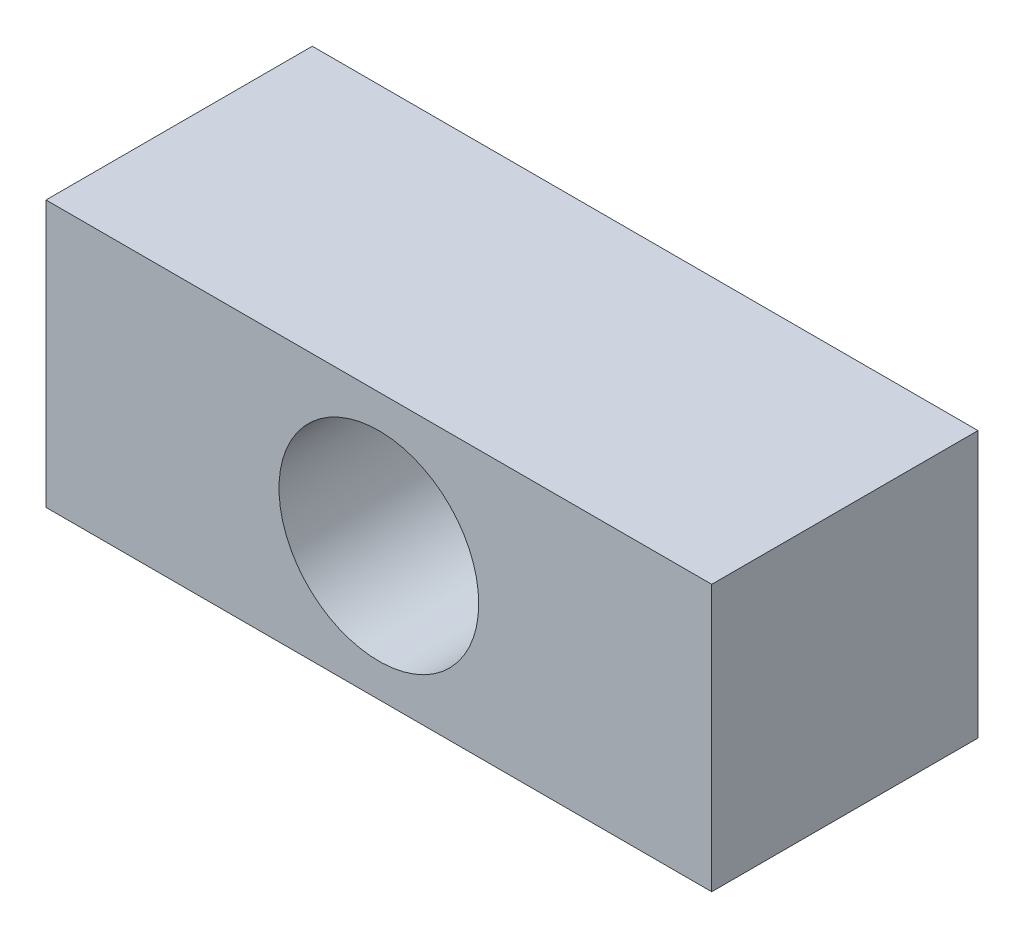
ISO-10303-21;
HEADER;
FILE_DESCRIPTION(('STEP AP214'),'2;1');
FILE_NAME('part.step','',(''),(''),'','','');
FILE_SCHEMA(('AUTOMOTIVE_DESIGN { 1 0 10303 214 1 1 1 1 }'));
ENDSEC;
DATA;
#1=APPLICATION_CONTEXT('core data for automotive mechanical design processes');
#2=APPLICATION_PROTOCOL_DEFINITION('international standard','automotive_design',2000,#1);
#3=PRODUCT_CONTEXT('',#1,'mechanical');
#4=PRODUCT('Part','Part','',(#3));
#5=PRODUCT_RELATED_PRODUCT_CATEGORY('part','',(#4));
#6=PRODUCT_DEFINITION_FORMATION('','',#4);
#7=PRODUCT_DEFINITION_CONTEXT('part definition',#1,'design');
#8=PRODUCT_DEFINITION('design','',#6,#7);
#9=PRODUCT_DEFINITION_SHAPE('','',#8);
#10=(LENGTH_UNIT() NAMED_UNIT(*) SI_UNIT(.MILLI.,.METRE.));
#11=(NAMED_UNIT(*) PLANE_ANGLE_UNIT() SI_UNIT($,.RADIAN.));
#12=(NAMED_UNIT(*) SI_UNIT($,.STERADIAN.) SOLID_ANGLE_UNIT());
#13=UNCERTAINTY_MEASURE_WITH_UNIT(LENGTH_MEASURE(1.E-05),#10,'distance_accuracy_value','');
#14=(GEOMETRIC_REPRESENTATION_CONTEXT(3) GLOBAL_UNCERTAINTY_ASSIGNED_CONTEXT((#13)) GLOBAL_UNIT_ASSIGNED_CONTEXT((#10,
#11,#12)) REPRESENTATION_CONTEXT('',''));
#15=CARTESIAN_POINT('',(0.,0.,0.));
#16=DIRECTION('',(0.,0.,1.));
#17=DIRECTION('',(1.,0.,0.));
#18=AXIS2_PLACEMENT_3D('',#15,#16,#17);
#19=CARTESIAN_POINT('',(0.,0.,40.));
#20=DIRECTION('',(0.,0.,-1.));
#21=DIRECTION('',(-1.,0.,0.));
#22=AXIS2_PLACEMENT_3D('',#19,#20,#21);
#23=PLANE('',#22);
#24=DIRECTION('',(0.,-1.,0.));
#25=VECTOR('',#24,1.);
#26=CARTESIAN_POINT('',(0.,0.,40.));
#27=LINE('',#26,#25);
#28=CARTESIAN_POINT('',(0.,40.,40.));
#29=VERTEX_POINT('',#28);
#30=CARTESIAN_POINT('',(0.,0.,40.));
#31=VERTEX_POINT('',#30);
#32=EDGE_CURVE('E84',#29,#31,#27,.T.);
#33=ORIENTED_EDGE('',*,*,#32,.T.);
#34=DIRECTION('',(1.,0.,0.));
#35=VECTOR('',#34,1.);
#36=CARTESIAN_POINT('',(0.,0.,40.));
#37=LINE('',#36,#35);
#38=CARTESIAN_POINT('',(100.,0.,40.));
#39=VERTEX_POINT('',#38);
#40=EDGE_CURVE('E79',#31,#39,#37,.T.);
#41=ORIENTED_EDGE('',*,*,#40,.T.);
#42=DIRECTION('',(0.,1.,0.));
#43=VECTOR('',#42,1.);
#44=CARTESIAN_POINT('',(100.,0.,40.));
#45=LINE('',#44,#43);
#46=CARTESIAN_POINT('',(100.,40.,40.));
#47=VERTEX_POINT('',#46);
#48=EDGE_CURVE('E82',#39,#47,#45,.T.);
#49=ORIENTED_EDGE('',*,*,#48,.T.);
#50=DIRECTION('',(-1.,0.,0.));
#51=VECTOR('',#50,1.);
#52=CARTESIAN_POINT('',(0.,40.,40.));
#53=LINE('',#52,#51);
#54=EDGE_CURVE('E49',#47,#29,#53,.T.);
#55=ORIENTED_EDGE('',*,*,#54,.T.);
#56=EDGE_LOOP('',(#33,#41,#49,#55));
#57=FACE_BOUND('',#56,.T.);
#58=CARTESIAN_POINT('',(50.,20.,40.));
#59=DIRECTION('',(0.,0.,1.));
#60=DIRECTION('',(1.,0.,0.));
#61=AXIS2_PLACEMENT_3D('',#58,#59,#60);
#62=CIRCLE('',#61,15.);
#63=CARTESIAN_POINT('',(65.,20.,40.));
#64=VERTEX_POINT('',#63);
#65=EDGE_CURVE('E99',#64,#64,#62,.T.);
#66=ORIENTED_EDGE('',*,*,#65,.F.);
#67=EDGE_LOOP('',(#66));
#68=FACE_BOUND('',#67,.T.);
#69=ADVANCED_FACE('F32',(#57,#68),#23,.F.);
#70=CARTESIAN_POINT('',(0.,0.,0.));
#71=DIRECTION('',(0.,0.,-1.));
#72=DIRECTION('',(-1.,0.,0.));
#73=AXIS2_PLACEMENT_3D('',#70,#71,#72);
#74=PLANE('',#73);
#75=DIRECTION('',(0.,-1.,0.));
#76=VECTOR('',#75,1.);
#77=CARTESIAN_POINT('',(0.,0.,0.));
#78=LINE('',#77,#76);
#79=CARTESIAN_POINT('',(0.,40.,0.));
#80=VERTEX_POINT('',#79);
#81=CARTESIAN_POINT('',(0.,0.,0.));
#82=VERTEX_POINT('',#81);
#83=EDGE_CURVE('E96',#80,#82,#78,.T.);
#84=ORIENTED_EDGE('',*,*,#83,.F.);
#85=DIRECTION('',(-1.,0.,0.));
#86=VECTOR('',#85,1.);
#87=CARTESIAN_POINT('',(0.,40.,0.));
#88=LINE('',#87,#86);
#89=CARTESIAN_POINT('',(100.,40.,0.));
#90=VERTEX_POINT('',#89);
#91=EDGE_CURVE('E72',#90,#80,#88,.T.);
#92=ORIENTED_EDGE('',*,*,#91,.F.);
#93=DIRECTION('',(0.,1.,0.));
#94=VECTOR('',#93,1.);
#95=CARTESIAN_POINT('',(100.,0.,0.));
#96=LINE('',#95,#94);
#97=CARTESIAN_POINT('',(100.,0.,0.));
#98=VERTEX_POINT('',#97);
#99=EDGE_CURVE('E66',#98,#90,#96,.T.);
#100=ORIENTED_EDGE('',*,*,#99,.F.);
#101=DIRECTION('',(1.,0.,0.));
#102=VECTOR('',#101,1.);
#103=CARTESIAN_POINT('',(0.,0.,0.));
#104=LINE('',#103,#102);
#105=EDGE_CURVE('E88',#82,#98,#104,.T.);
#106=ORIENTED_EDGE('',*,*,#105,.F.);
#107=EDGE_LOOP('',(#84,#92,#100,#106));
#108=FACE_BOUND('',#107,.T.);
#109=CARTESIAN_POINT('',(50.,20.,0.));
#110=DIRECTION('',(0.,0.,1.));
#111=DIRECTION('',(1.,0.,0.));
#112=AXIS2_PLACEMENT_3D('',#109,#110,#111);
#113=CIRCLE('',#112,15.);
#114=CARTESIAN_POINT('',(65.,20.,0.));
#115=VERTEX_POINT('',#114);
#116=EDGE_CURVE('E111',#115,#115,#113,.T.);
#117=ORIENTED_EDGE('',*,*,#116,.T.);
#118=EDGE_LOOP('',(#117));
#119=FACE_BOUND('',#118,.T.);
#120=ADVANCED_FACE('F107',(#108,#119),#74,.T.);
#121=CARTESIAN_POINT('',(0.,0.,40.));
#122=DIRECTION('',(1.,0.,0.));
#123=DIRECTION('',(0.,0.,-1.));
#124=AXIS2_PLACEMENT_3D('',#121,#122,#123);
#125=PLANE('',#124);
#126=ORIENTED_EDGE('',*,*,#83,.T.);
#127=DIRECTION('',(0.,0.,-1.));
#128=VECTOR('',#127,1.);
#129=CARTESIAN_POINT('',(0.,0.,40.));
#130=LINE('',#129,#128);
#131=EDGE_CURVE('E11',#31,#82,#130,.T.);
#132=ORIENTED_EDGE('',*,*,#131,.F.);
#133=ORIENTED_EDGE('',*,*,#32,.F.);
#134=DIRECTION('',(0.,0.,-1.));
#135=VECTOR('',#134,1.);
#136=CARTESIAN_POINT('',(0.,40.,40.));
#137=LINE('',#136,#135);
#138=EDGE_CURVE('E92',#29,#80,#137,.T.);
#139=ORIENTED_EDGE('',*,*,#138,.T.);
#140=EDGE_LOOP('',(#126,#132,#133,#139));
#141=FACE_BOUND('',#140,.T.);
#142=ADVANCED_FACE('F34',(#141),#125,.F.);
#143=CARTESIAN_POINT('',(0.,0.,40.));
#144=DIRECTION('',(0.,1.,0.));
#145=DIRECTION('',(0.,0.,1.));
#146=AXIS2_PLACEMENT_3D('',#143,#144,#145);
#147=PLANE('',#146);
#148=ORIENTED_EDGE('',*,*,#105,.T.);
#149=DIRECTION('',(0.,0.,-1.));
#150=VECTOR('',#149,1.);
#151=CARTESIAN_POINT('',(100.,0.,40.));
#152=LINE('',#151,#150);
#153=EDGE_CURVE('E41',#39,#98,#152,.T.);
#154=ORIENTED_EDGE('',*,*,#153,.F.);
#155=ORIENTED_EDGE('',*,*,#40,.F.);
#156=ORIENTED_EDGE('',*,*,#131,.T.);
#157=EDGE_LOOP('',(#148,#154,#155,#156));
#158=FACE_BOUND('',#157,.T.);
#159=ADVANCED_FACE('F87',(#158),#147,.F.);
#160=CARTESIAN_POINT('',(100.,0.,40.));
#161=DIRECTION('',(-1.,0.,0.));
#162=DIRECTION('',(0.,0.,1.));
#163=AXIS2_PLACEMENT_3D('',#160,#161,#162);
#164=PLANE('',#163);
#165=ORIENTED_EDGE('',*,*,#99,.T.);
#166=DIRECTION('',(0.,0.,-1.));
#167=VECTOR('',#166,1.);
#168=CARTESIAN_POINT('',(100.,40.,40.));
#169=LINE('',#168,#167);
#170=EDGE_CURVE('E89',#47,#90,#169,.T.);
#171=ORIENTED_EDGE('',*,*,#170,.F.);
#172=ORIENTED_EDGE('',*,*,#48,.F.);
#173=ORIENTED_EDGE('',*,*,#153,.T.);
#174=EDGE_LOOP('',(#165,#171,#172,#173));
#175=FACE_BOUND('',#174,.T.);
#176=ADVANCED_FACE('F90',(#175),#164,.F.);
#177=CARTESIAN_POINT('',(0.,40.,40.));
#178=DIRECTION('',(0.,-1.,0.));
#179=DIRECTION('',(0.,0.,-1.));
#180=AXIS2_PLACEMENT_3D('',#177,#178,#179);
#181=PLANE('',#180);
#182=ORIENTED_EDGE('',*,*,#91,.T.);
#183=ORIENTED_EDGE('',*,*,#138,.F.);
#184=ORIENTED_EDGE('',*,*,#54,.F.);
#185=ORIENTED_EDGE('',*,*,#170,.T.);
#186=EDGE_LOOP('',(#182,#183,#184,#185));
#187=FACE_BOUND('',#186,.T.);
#188=ADVANCED_FACE('F104',(#187),#181,.F.);
#189=CARTESIAN_POINT('',(50.,20.,40.));
#190=DIRECTION('',(0.,0.,-1.));
#191=DIRECTION('',(-1.,0.,0.));
#192=AXIS2_PLACEMENT_3D('',#189,#190,#191);
#193=CYLINDRICAL_SURFACE('',#192,15.);
#194=ORIENTED_EDGE('',*,*,#65,.T.);
#195=EDGE_LOOP('',(#194));
#196=FACE_BOUND('',#195,.T.);
#197=ORIENTED_EDGE('',*,*,#116,.F.);
#198=EDGE_LOOP('',(#197));
#199=FACE_BOUND('',#198,.T.);
#200=ADVANCED_FACE('F117',(#196,#199),#193,.F.);
#201=CLOSED_SHELL('',(#69,#120,#142,#159,#176,#188,#200));
#202=MANIFOLD_SOLID_BREP('B2',#201);
#203=ADVANCED_BREP_SHAPE_REPRESENTATION('',(#18,#202),#14);
#204=SHAPE_DEFINITION_REPRESENTATION(#9,#203);
ENDSEC;
END-ISO-10303-21;
